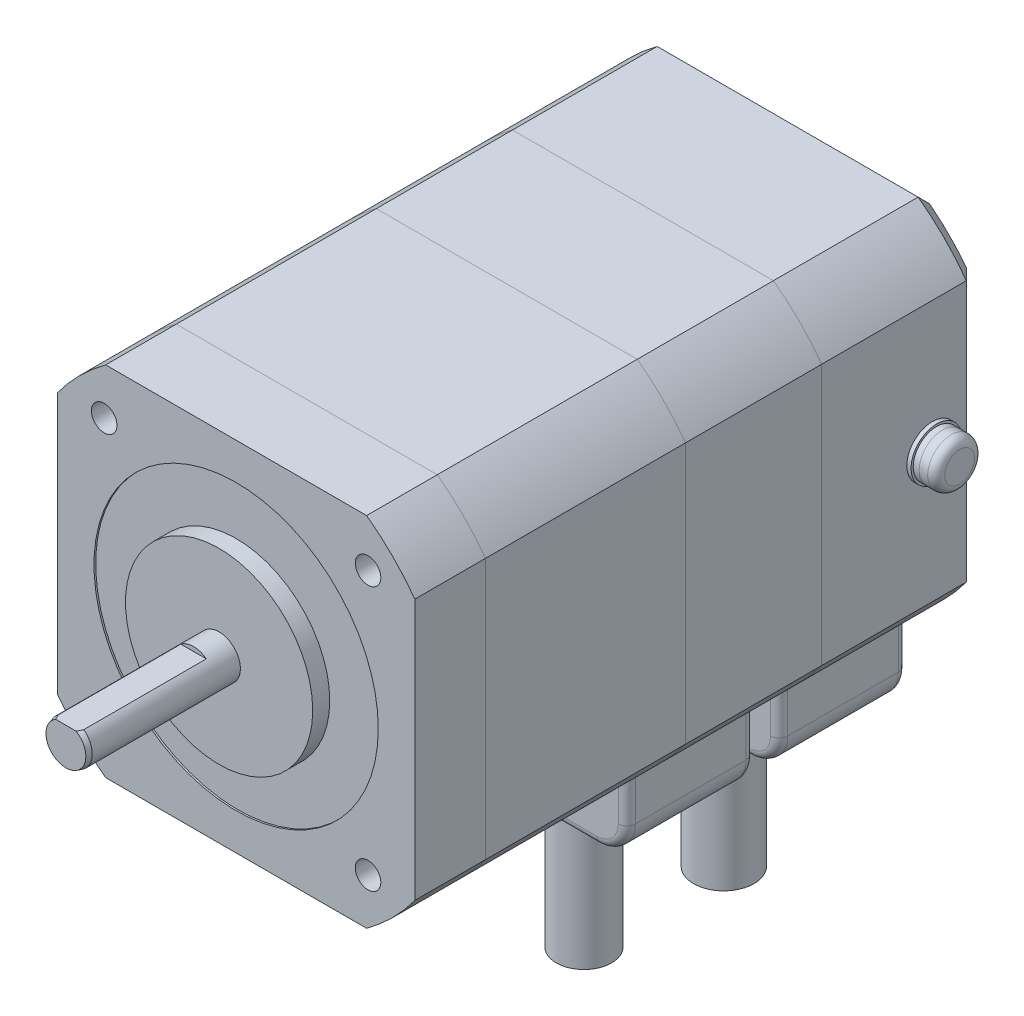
from build123d import *

# Parameters (mm, degrees)
SKETCH_1_R          = 2.5
EXTRUDE_1_DEPTH     = 20
EXTRUDE_2_DEPTH     = 8.3
EXTRUDE_3_DEPTH     = 23.5
EXTRUDE_4_DEPTH     = 16
EXTRUDE_5_DEPTH     = 19
SKETCH_6_W          = 28
SKETCH_6_H          = 15
EXTRUDE_6_DEPTH     = 10
SKETCH_7_W          = 28
SKETCH_7_H          = 15
EXTRUDE_7_DEPTH     = 10
CHAMFER_2_SIZE      = 0.6
CHAMFER_2_SIZE2     = 0.160769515
SKETCH_8_W          = 10.380008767
SKETCH_8_H          = 5.893166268
CUT_EXTRUDE_1_DEPTH = 15
SKETCH_9_R          = 11
EXTRUDE_8_DEPTH     = 2
SKETCH_10_R         = 1.5
CUT_EXTRUDE_2_DEPTH = 4.5
FILLET_1_R          = 3.5
FILLET_2_R          = 3.5
SKETCH_11_R         = 3
EXTRUDE_9_DEPTH     = 0.5
SKETCH_12_R         = 2.75
EXTRUDE_10_DEPTH    = 0.7
SKETCH_13_R         = 2.75
EXTRUDE_11_DEPTH    = 2
FILLET_3_R          = 1
SKETCH_14_R         = 3.55
EXTRUDE_12_DEPTH    = 20
SKETCH_15_R         = 3.25
EXTRUDE_13_DEPTH    = 20
CHAMFER_1_SIZE      = 2
SKETCH_16_R         = 16.7
CUT_EXTRUDE_3_DEPTH = 0.2
FILLET_4_R          = 1
FILLET_5_R          = 1


with BuildPart() as part:
    # Sketch 1 → Extrude 1 (new body)
    with BuildSketch(Plane.XY):
        Circle(SKETCH_1_R)
    extrude(amount=EXTRUDE_1_DEPTH)

    # Chamfer 2
    chamfer_2_edges = [part.edges().sort_by_distance(p)[0] for p in [
        (-2.5, 0, 20),
    ]]
    chamfer_2_side = [part.faces().sort_by_distance(p)[0] for p in [
        (-2.5, 0, 10),
    ]]
    chamfer(chamfer_2_edges, length=CHAMFER_2_SIZE, length2=CHAMFER_2_SIZE2, reference=chamfer_2_side[0])

    # Sketch 8 → Cut-Extrude 1 (cut)
    with BuildSketch(Plane.XY.offset(20)):
        with Locations((0.770129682, 4.946583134)):
            Rectangle(SKETCH_8_W, SKETCH_8_H)
    extrude(amount=-CUT_EXTRUDE_1_DEPTH, mode=Mode.SUBTRACT)



with BuildPart() as body_2:
    # Sketch 2 → Extrude 2 (new body)
    with BuildSketch(Plane.XY):
        with BuildLine():
            ThreePointArc((-21, -15.329709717), (-18.384776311, -18.384776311), (-15.329709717, -21))
            Line((-15.329709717, -21), (15.329709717, -21))
            ThreePointArc((15.329709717, -21), (18.384776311, -18.384776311), (21, -15.329709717))
            Line((21, -15.329709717), (21, 15.329709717))
            ThreePointArc((21, 15.329709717), (18.384776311, 18.384776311), (15.329709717, 21))
            Line((15.329709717, 21), (-15.329709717, 21))
            ThreePointArc((-15.329709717, 21), (-18.384776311, 18.384776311), (-21, 15.329709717))
            Line((-21, 15.329709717), (-21, -15.329709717))
        make_face()
    extrude(amount=-EXTRUDE_2_DEPTH)


with BuildPart() as body_3:
    # Sketch 3 → Extrude 3 (new body)
    with BuildSketch(Plane(origin=(0, 0, -8.3), x_dir=(-1, 0, 0), z_dir=(0, 0, -1))):
        with BuildLine():
            Line((-21, 15.329709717), (-21, -15.329709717))
            ThreePointArc((-21, -15.329709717), (-18.384776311, -18.384776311), (-15.329709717, -21))
            Line((-15.329709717, -21), (15.329709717, -21))
            ThreePointArc((15.329709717, -21), (18.384776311, -18.384776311), (21, -15.329709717))
            Line((21, -15.329709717), (21, 15.329709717))
            ThreePointArc((21, 15.329709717), (18.384776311, 18.384776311), (15.329709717, 21))
            Line((15.329709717, 21), (-15.329709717, 21))
            ThreePointArc((-15.329709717, 21), (-18.384776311, 18.384776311), (-21, 15.329709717))
        make_face()
    extrude(amount=EXTRUDE_3_DEPTH)


with BuildPart() as body_4:
    # Sketch 4 → Extrude 4 (new body)
    with BuildSketch(Plane(origin=(0, 0, -31.8), x_dir=(-1, 0, 0), z_dir=(0, 0, -1))):
        with BuildLine():
            Line((-21, 15.329709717), (-21, -15.329709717))
            ThreePointArc((-21, -15.329709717), (-18.384776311, -18.384776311), (-15.329709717, -21))
            Line((-15.329709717, -21), (15.329709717, -21))
            ThreePointArc((15.329709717, -21), (18.384776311, -18.384776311), (21, -15.329709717))
            Line((21, -15.329709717), (21, 15.329709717))
            ThreePointArc((21, 15.329709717), (18.384776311, 18.384776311), (15.329709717, 21))
            Line((15.329709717, 21), (-15.329709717, 21))
            ThreePointArc((-15.329709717, 21), (-18.384776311, 18.384776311), (-21, 15.329709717))
        make_face()
    extrude(amount=EXTRUDE_4_DEPTH)


with BuildPart() as body_5:
    # Sketch 5 → Extrude 5 (new body)
    with BuildSketch(Plane(origin=(0, 0, -47.8), x_dir=(-1, 0, 0), z_dir=(0, 0, -1))):
        with BuildLine():
            Line((-21, 15.329709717), (-21, -15.329709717))
            ThreePointArc((-21, -15.329709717), (-18.384776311, -18.384776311), (-15.329709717, -21))
            Line((-15.329709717, -21), (15.329709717, -21))
            ThreePointArc((15.329709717, -21), (18.384776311, -18.384776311), (21, -15.329709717))
            Line((21, -15.329709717), (21, 15.329709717))
            ThreePointArc((21, 15.329709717), (18.384776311, 18.384776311), (15.329709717, 21))
            Line((15.329709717, 21), (-15.329709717, 21))
            ThreePointArc((-15.329709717, 21), (-18.384776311, 18.384776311), (-21, 15.329709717))
        make_face()
    extrude(amount=EXTRUDE_5_DEPTH)

    # Chamfer 1
    chamfer_1_edges = [body_5.edges().sort_by_distance(p)[0] for p in [
        (18.384776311, -18.384776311, -66.8),
        (0, -21, -66.8),
        (-18.384776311, -18.384776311, -66.8),
        (-21, 0, -66.8),
        (-18.384776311, 18.384776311, -66.8),
        (0, 21, -66.8),
        (18.384776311, 18.384776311, -66.8),
        (21, 0, -66.8),
    ]]
    chamfer(chamfer_1_edges, length=CHAMFER_1_SIZE)


with BuildPart() as body_6:
    # Sketch 6 → Extrude 6 (new body)
    with BuildSketch(Plane.XZ.offset(21)):
        with Locations((0, -39.4)):
            Rectangle(SKETCH_6_W, SKETCH_6_H)
    extrude(amount=EXTRUDE_6_DEPTH)

    # Fillet 1
    fillet_1_edges = [body_6.edges().sort_by_distance(p)[0] for p in [
        (14, -31, -39.4),
        (-14, -31, -39.4),
    ]]
    fillet(fillet_1_edges, radius=FILLET_1_R)

    # Fillet 4
    fillet_4_edges = [body_6.edges().sort_by_distance(p)[0] for p in [
        (0, -31, -46.9),
        (0, -31, -31.9),
        (14, -24.25, -46.9),
        (-14, -24.25, -46.9),
        (12.974873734, -29.974873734, -46.9),
        (-12.974873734, -29.974873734, -46.9),
        (-14, -24.25, -31.9),
        (14, -24.25, -31.9),
        (12.974873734, -29.974873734, -31.9),
        (-12.974873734, -29.974873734, -31.9),
    ]]
    fillet(fillet_4_edges, radius=FILLET_4_R)


with BuildPart() as body_7:
    # Sketch 7 → Extrude 7 (new body)
    with BuildSketch(Plane.XZ.offset(21)):
        with Locations((0, -57.3)):
            Rectangle(SKETCH_7_W, SKETCH_7_H)
    extrude(amount=EXTRUDE_7_DEPTH)

    # Fillet 2
    fillet_2_edges = [body_7.edges().sort_by_distance(p)[0] for p in [
        (14, -31, -57.3),
        (-14, -31, -57.3),
    ]]
    fillet(fillet_2_edges, radius=FILLET_2_R)

    # Fillet 5
    fillet_5_edges = [body_7.edges().sort_by_distance(p)[0] for p in [
        (0, -31, -64.8),
        (0, -31, -49.8),
        (14, -24.25, -64.8),
        (-14, -24.25, -64.8),
        (12.974873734, -29.974873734, -64.8),
        (-12.974873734, -29.974873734, -64.8),
        (-14, -24.25, -49.8),
        (14, -24.25, -49.8),
        (12.974873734, -29.974873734, -49.8),
        (-12.974873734, -29.974873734, -49.8),
    ]]
    fillet(fillet_5_edges, radius=FILLET_5_R)


with BuildPart() as part_1:
    add(part.part)

    add(body_2.part)  # Extrude 8 merges body 2
    # Sketch 9 → Extrude 8 (add)
    with BuildSketch(Plane.XY):
        Circle(SKETCH_9_R)
    extrude(amount=EXTRUDE_8_DEPTH)

    # Sketch 10 → Cut-Extrude 2 (cut)
    with BuildSketch(Plane.XY):
        with Locations((15.5, 15.5)):
            Circle(SKETCH_10_R)
        with Locations((15.5, -15.5)):
            Circle(SKETCH_10_R)
        with Locations((-15.5, -15.5)):
            Circle(SKETCH_10_R)
        with Locations((-15.5, 15.5)):
            Circle(SKETCH_10_R)
    extrude(amount=-CUT_EXTRUDE_2_DEPTH, mode=Mode.SUBTRACT)

    # Sketch 16 → Cut-Extrude 3 (cut)
    with BuildSketch(Plane.XY):
        Circle(SKETCH_16_R)
    extrude(amount=-CUT_EXTRUDE_3_DEPTH, mode=Mode.SUBTRACT)


with BuildPart() as body_7_2:
    # Sketch 11 → Extrude 9 (new body)
    with BuildSketch(Plane(origin=(21, 0, 0), x_dir=(0, 0, -1), z_dir=(1, 0, 0))):
        with Locations(Location((60.8, 0, 0), (0, 0, 90))):
            Circle(SKETCH_11_R)
    extrude(amount=EXTRUDE_9_DEPTH)


with BuildPart() as body_8:
    # Sketch 12 → Extrude 10 (new body)
    with BuildSketch(Plane(origin=(21.5, 0, 0), x_dir=(0, 0, -1), z_dir=(1, 0, 0))):
        with Locations(Location((60.8, 0, 0), (0, 0, 90))):
            Circle(SKETCH_12_R)
    extrude(amount=EXTRUDE_10_DEPTH)


with BuildPart() as body_9:
    # Sketch 13 → Extrude 11 (new body)
    with BuildSketch(Plane(origin=(22.2, 0, 0), x_dir=(0, 0, -1), z_dir=(1, 0, 0))):
        with Locations(Location((60.8, 0, 0), (0, 0, 90))):
            Circle(SKETCH_13_R)
    extrude(amount=EXTRUDE_11_DEPTH)

    # Fillet 3
    fillet_3_edges = [body_9.edges().sort_by_distance(p)[0] for p in [
        (24.2, -2.75, -60.8),
    ]]
    fillet(fillet_3_edges, radius=FILLET_3_R)


with BuildPart() as body_10:
    # Sketch 14 → Extrude 12 (new body)
    with BuildSketch(Plane.XZ.offset(31)):
        with Locations(Location((0, -57.3, 0), (0, 0, 270))):
            Circle(SKETCH_14_R)
    extrude(amount=EXTRUDE_12_DEPTH)


with BuildPart() as body_11:
    # Sketch 15 → Extrude 13 (new body)
    with BuildSketch(Plane.XZ.offset(31)):
        with Locations((0, -40.87)):
            Circle(SKETCH_15_R)
    extrude(amount=EXTRUDE_13_DEPTH)


with BuildPart() as cut_extrude_3_piece_1:
    # of the separate pieces the step leaves, piece 1, a body of its own (cut_extrude_3_pieces)
    add(part_1.part.solids().sort_by_distance((-15.329709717, 21, 0))[0])


with BuildPart() as cut_extrude_3_piece_2:
    # of the separate pieces the step leaves, piece 2, a body of its own (cut_extrude_3_pieces)
    add(part_1.part.solids().sort_by_distance((11, 0, 0))[0])


solid = Compound([body_3.part, body_4.part, body_5.part, body_6.part, body_7.part, body_7_2.part, body_8.part, body_9.part, body_10.part, body_11.part, cut_extrude_3_piece_1.part, cut_extrude_3_piece_2.part])
